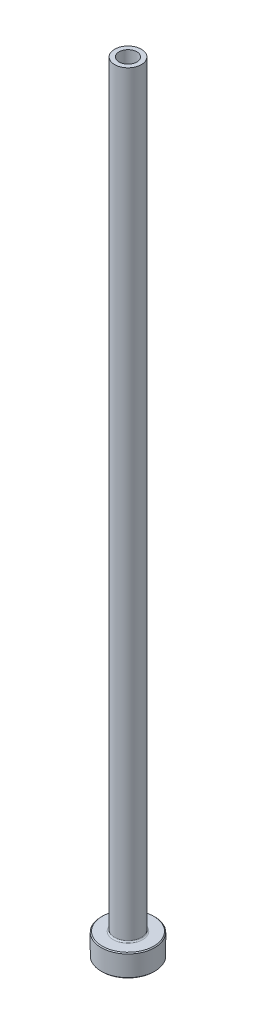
from build123d import *

# Parameters (mm, degrees)
FILLET1_R     = 0.3
CHAMFER1_SIZE = 0.2
CHAMFER3_SIZE = 0.5


with BuildPart() as part:
    # Sketch1 → Revolve1 (revolve)
    with BuildSketch(Plane.XY, mode=Mode.PRIVATE) as revolve1_sk:
        Polygon((-2, 175), (-3, 175), (-3, 5), (-6, 5), (-6, 0), (-2.25, 0), (-2.25, 118), (-2, 130), align=None)
    revolve(revolve1_sk.sketch.rotate(Axis((0, 92.187680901, 0), (0, -1, 0)), 270), axis=Axis((0, 92.187680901, 0), (0, -1, 0)))

    # Fillet1
    fillet1_edges = [part.edges().sort_by_distance(p)[0] for p in [
        (0, 5, -3),
    ]]
    fillet(fillet1_edges, radius=FILLET1_R)

    # Chamfer1
    chamfer1_edges = [part.edges().sort_by_distance(p)[0] for p in [
        (0, 0, -6),
        (0, 5, -6),
    ]]
    chamfer(chamfer1_edges, length=CHAMFER1_SIZE)

    # Chamfer3
    chamfer3_edges = [part.edges().sort_by_distance(p)[0] for p in [
        (0, 0, -2.25),
    ]]
    chamfer(chamfer3_edges, length=CHAMFER3_SIZE)


solid = part.part
